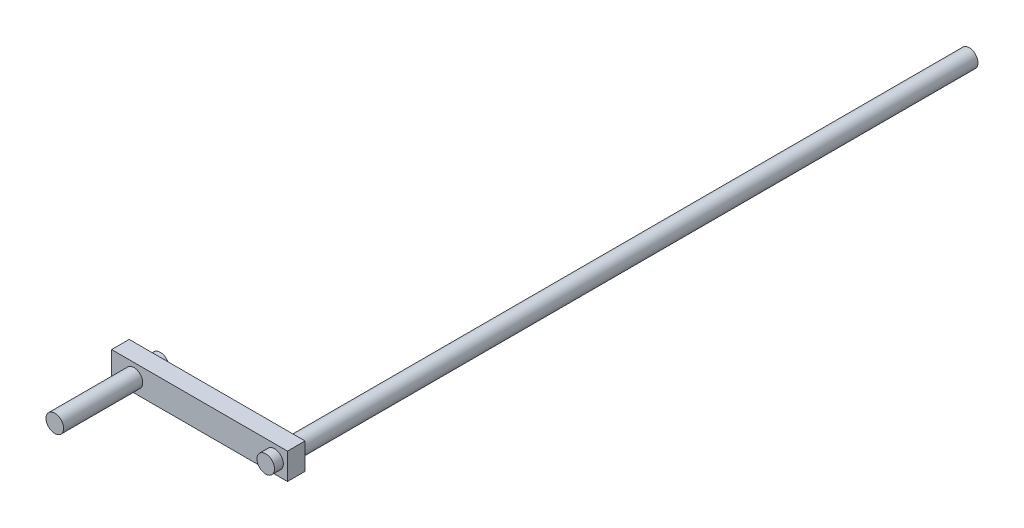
from build123d import *

# Parameters (mm, degrees)
SKETCH1_R      = 1
EXTRUDE1_DEPTH = 80
EXTRUDE2_START = -1
SKETCH2_W      = 20
SKETCH2_H      = 3
EXTRUDE2_DEPTH = 2
EXTRUDE3_START = 1
SKETCH3_R      = 1
EXTRUDE3_DEPTH = 12


with BuildPart() as part:
    # Sketch1 → Extrude1 (new body)
    with BuildSketch(Plane.XY):
        Circle(SKETCH1_R)
    extrude(amount=EXTRUDE1_DEPTH)

    # Sketch2 → Extrude2 (add)
    with BuildSketch(Plane.XY.offset(80).offset(EXTRUDE2_START)):
        with Locations((-8.528827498, 0)):
            Rectangle(SKETCH2_W, SKETCH2_H)
    extrude(amount=-EXTRUDE2_DEPTH)

    # Sketch3 → Extrude3 (add)
    with BuildSketch(Plane(origin=(0, 0, 77), x_dir=(-1, 0, 0), z_dir=(0, 0, -1)).offset(EXTRUDE3_START)):
        with Locations((15.988942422, 0)):
            Circle(SKETCH3_R)
    extrude(amount=-EXTRUDE3_DEPTH)


solid = part.part
